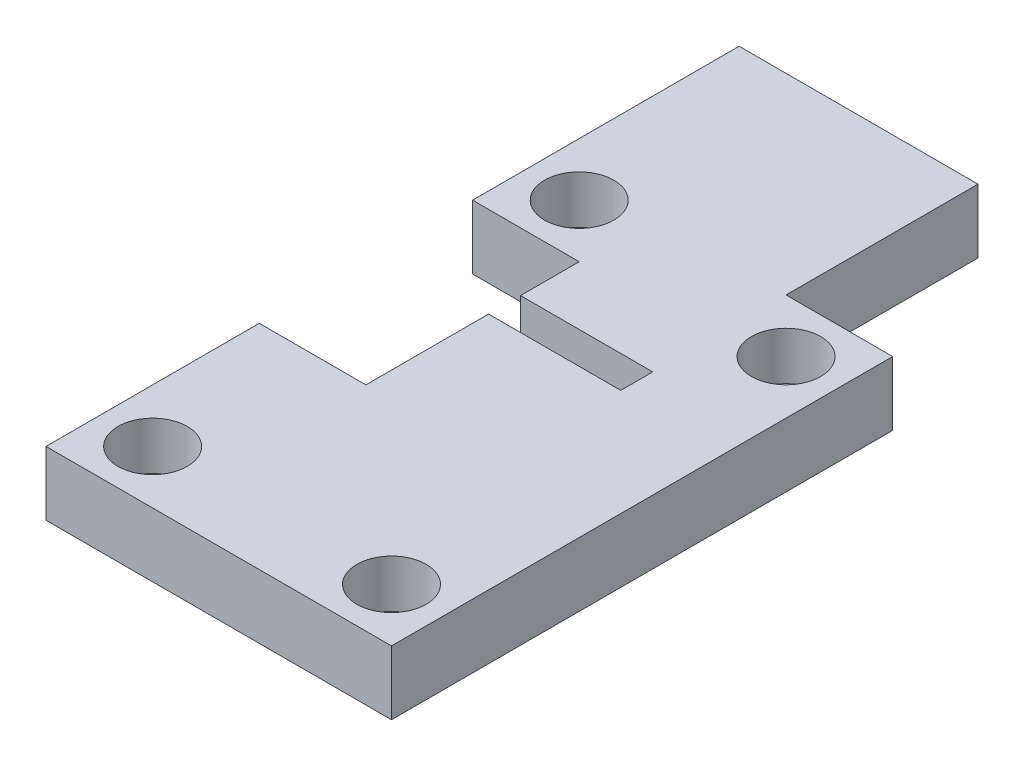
from build123d import *

# Parameters (mm, degrees)
SKETCH_1_W          = 32.4
SKETCH_1_H          = 6
EXTRUDE_1_DEPTH     = 65
SKETCH_2_OUTSIDE_W  = 48.974
SKETCH_2_OUTSIDE_H  = 81.574
SKETCH_2_OUTSIDE_R  = 1.75
CUT_EXTRUDE_1_DEPTH = 65
SKETCH_3_R          = 3.25
CUT_EXTRUDE_2_DEPTH = 4.5


with BuildPart() as part:
    # Sketch 1 → Extrude 1 (new body)
    with BuildSketch(Plane.XY):
        with Locations((16.2, 3)):
            Rectangle(SKETCH_1_W, SKETCH_1_H)
    extrude(amount=EXTRUDE_1_DEPTH)

    # Sketch 2 outside → Cut-Extrude 1 (cut)
    # profile 1 of 5: a face of its own
    with BuildSketch(Plane(origin=(0, 6, 0), x_dir=(1, 0, 0), z_dir=(0, 1, 0))):
        with Locations((16.2, -32.5)):
            Rectangle(SKETCH_2_OUTSIDE_W, SKETCH_2_OUTSIDE_H)
        Polygon((0, -65), (32.4, -65), (32.4, -18), (22.4, -18), (22.4, 0), (0, 0), (0, -25), (10, -25), (10, -30.5), (22.4, -30.5), (22.4, -33.5), (10, -33.5), (10, -45), (0, -45), align=None, mode=Mode.SUBTRACT)
    # profile 2 of 5: a face of its own
    with BuildSketch(Plane(origin=(0, 6, 0), x_dir=(1, 0, 0), z_dir=(0, 1, 0))):
        with Locations(Location((27.4, -23, 0), (0, 0, 270))):
            Circle(SKETCH_2_OUTSIDE_R)
    # profile 3 of 5: a face of its own
    with BuildSketch(Plane(origin=(0, 6, 0), x_dir=(1, 0, 0), z_dir=(0, 1, 0))):
        with Locations(Location((27.4, -60, 0), (0, 0, 270))):
            Circle(SKETCH_2_OUTSIDE_R)
    # profile 4 of 5: a face of its own
    with BuildSketch(Plane(origin=(0, 6, 0), x_dir=(1, 0, 0), z_dir=(0, 1, 0))):
        with Locations(Location((5, -60, 0), (0, 0, 270))):
            Circle(SKETCH_2_OUTSIDE_R)
    # profile 5 of 5: a face of its own
    with BuildSketch(Plane(origin=(0, 6, 0), x_dir=(1, 0, 0), z_dir=(0, 1, 0))):
        with Locations(Location((5, -20, 0), (0, 0, 270))):
            Circle(SKETCH_2_OUTSIDE_R)
    extrude(amount=-CUT_EXTRUDE_1_DEPTH, mode=Mode.SUBTRACT)

    # Sketch 3 → Cut-Extrude 2 (cut)
    with BuildSketch(Plane(origin=(0, 6, 0), x_dir=(1, 0, 0), z_dir=(0, 1, 0))):
        with Locations(Location((27.4, -23, 0), (0, 0, 270))):
            Circle(SKETCH_3_R)
        with Locations(Location((27.4, -60, 0), (0, 0, 270))):
            Circle(SKETCH_3_R)
        with Locations(Location((5, -60, 0), (0, 0, 270))):
            Circle(SKETCH_3_R)
        with Locations(Location((5, -20, 0), (0, 0, 270))):
            Circle(SKETCH_3_R)
    extrude(amount=-CUT_EXTRUDE_2_DEPTH, mode=Mode.SUBTRACT)


solid = part.part
